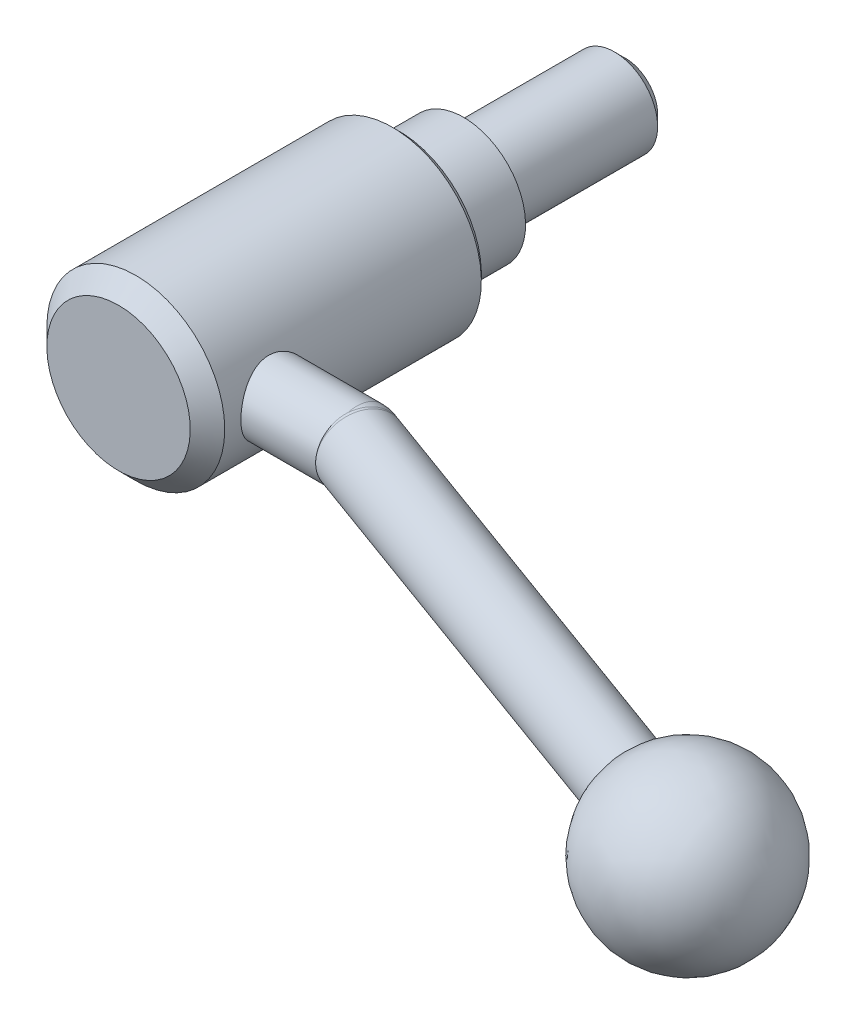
ISO-10303-21;
HEADER;
FILE_DESCRIPTION(('STEP AP214'),'2;1');
FILE_NAME('part.step','',(''),(''),'','','');
FILE_SCHEMA(('AUTOMOTIVE_DESIGN { 1 0 10303 214 1 1 1 1 }'));
ENDSEC;
DATA;
#1=APPLICATION_CONTEXT('core data for automotive mechanical design processes');
#2=APPLICATION_PROTOCOL_DEFINITION('international standard','automotive_design',2000,#1);
#3=PRODUCT_CONTEXT('',#1,'mechanical');
#4=PRODUCT('Part','Part','',(#3));
#5=PRODUCT_RELATED_PRODUCT_CATEGORY('part','',(#4));
#6=PRODUCT_DEFINITION_FORMATION('','',#4);
#7=PRODUCT_DEFINITION_CONTEXT('part definition',#1,'design');
#8=PRODUCT_DEFINITION('design','',#6,#7);
#9=PRODUCT_DEFINITION_SHAPE('','',#8);
#10=(LENGTH_UNIT() NAMED_UNIT(*) SI_UNIT(.MILLI.,.METRE.));
#11=(NAMED_UNIT(*) PLANE_ANGLE_UNIT() SI_UNIT($,.RADIAN.));
#12=(NAMED_UNIT(*) SI_UNIT($,.STERADIAN.) SOLID_ANGLE_UNIT());
#13=UNCERTAINTY_MEASURE_WITH_UNIT(LENGTH_MEASURE(1.E-05),#10,'distance_accuracy_value','');
#14=(GEOMETRIC_REPRESENTATION_CONTEXT(3) GLOBAL_UNCERTAINTY_ASSIGNED_CONTEXT((#13)) GLOBAL_UNIT_ASSIGNED_CONTEXT((#10,
#11,#12)) REPRESENTATION_CONTEXT('',''));
#15=CARTESIAN_POINT('',(0.,0.,0.));
#16=DIRECTION('',(0.,0.,1.));
#17=DIRECTION('',(1.,0.,0.));
#18=AXIS2_PLACEMENT_3D('',#15,#16,#17);
#19=CARTESIAN_POINT('',(0.,0.,-14.386565));
#20=DIRECTION('',(0.,0.,1.));
#21=DIRECTION('',(0.,-1.,0.));
#22=AXIS2_PLACEMENT_3D('',#19,#20,#21);
#23=CYLINDRICAL_SURFACE('',#22,8.);
#24=CARTESIAN_POINT('',(0.,0.,-28.));
#25=DIRECTION('',(0.,0.,-1.));
#26=DIRECTION('',(-1.,0.,0.));
#27=AXIS2_PLACEMENT_3D('',#24,#25,#26);
#28=CIRCLE('',#27,8.);
#29=CARTESIAN_POINT('',(-8.,0.,-28.));
#30=VERTEX_POINT('',#29);
#31=EDGE_CURVE('E9',#30,#30,#28,.F.);
#32=ORIENTED_EDGE('',*,*,#31,.T.);
#33=EDGE_LOOP('',(#32));
#34=FACE_BOUND('',#33,.T.);
#35=CARTESIAN_POINT('',(0.,0.,0.));
#36=DIRECTION('',(0.,0.,1.));
#37=DIRECTION('',(0.,-1.,0.));
#38=AXIS2_PLACEMENT_3D('',#35,#36,#37);
#39=CIRCLE('',#38,8.);
#40=CARTESIAN_POINT('',(0.,-8.,0.));
#41=VERTEX_POINT('',#40);
#42=EDGE_CURVE('E144',#41,#41,#39,.T.);
#43=ORIENTED_EDGE('',*,*,#42,.F.);
#44=EDGE_LOOP('',(#43));
#45=FACE_BOUND('',#44,.T.);
#46=ADVANCED_FACE('F14',(#34,#45),#23,.T.);
#47=CARTESIAN_POINT('',(9.75,0.,0.));
#48=DIRECTION('',(0.,0.,-1.));
#49=DIRECTION('',(0.,1.,0.));
#50=AXIS2_PLACEMENT_3D('',#47,#48,#49);
#51=PLANE('',#50);
#52=ORIENTED_EDGE('',*,*,#42,.T.);
#53=EDGE_LOOP('',(#52));
#54=FACE_BOUND('',#53,.T.);
#55=CARTESIAN_POINT('',(0.,0.,0.));
#56=DIRECTION('',(0.,0.,1.));
#57=DIRECTION('',(0.,-1.,0.));
#58=AXIS2_PLACEMENT_3D('',#55,#56,#57);
#59=CIRCLE('',#58,11.5);
#60=CARTESIAN_POINT('',(0.,-11.5,0.));
#61=VERTEX_POINT('',#60);
#62=EDGE_CURVE('E141',#61,#61,#59,.T.);
#63=ORIENTED_EDGE('',*,*,#62,.F.);
#64=EDGE_LOOP('',(#63));
#65=FACE_BOUND('',#64,.T.);
#66=ADVANCED_FACE('F148',(#54,#65),#51,.T.);
#67=CARTESIAN_POINT('',(0.,0.,6.));
#68=DIRECTION('',(0.,0.,1.));
#69=DIRECTION('',(0.,-1.,0.));
#70=AXIS2_PLACEMENT_3D('',#67,#68,#69);
#71=CYLINDRICAL_SURFACE('',#70,11.5);
#72=CARTESIAN_POINT('',(0.,0.,12.));
#73=DIRECTION('',(0.,0.,1.));
#74=DIRECTION('',(0.,-1.,0.));
#75=AXIS2_PLACEMENT_3D('',#72,#73,#74);
#76=CIRCLE('',#75,11.5);
#77=CARTESIAN_POINT('',(0.,-11.5,12.));
#78=VERTEX_POINT('',#77);
#79=EDGE_CURVE('E136',#78,#78,#76,.T.);
#80=ORIENTED_EDGE('',*,*,#79,.F.);
#81=EDGE_LOOP('',(#80));
#82=FACE_BOUND('',#81,.T.);
#83=ORIENTED_EDGE('',*,*,#62,.T.);
#84=EDGE_LOOP('',(#83));
#85=FACE_BOUND('',#84,.T.);
#86=ADVANCED_FACE('F158',(#82,#85),#71,.T.);
#87=CARTESIAN_POINT('',(13.4,0.,12.));
#88=DIRECTION('',(0.,0.,-1.));
#89=DIRECTION('',(0.,1.,0.));
#90=AXIS2_PLACEMENT_3D('',#87,#88,#89);
#91=PLANE('',#90);
#92=ORIENTED_EDGE('',*,*,#79,.T.);
#93=EDGE_LOOP('',(#92));
#94=FACE_BOUND('',#93,.T.);
#95=CARTESIAN_POINT('',(0.,0.,12.));
#96=DIRECTION('',(0.,0.,1.));
#97=DIRECTION('',(0.,-1.,0.));
#98=AXIS2_PLACEMENT_3D('',#95,#96,#97);
#99=CIRCLE('',#98,15.3);
#100=CARTESIAN_POINT('',(0.,-15.3,12.));
#101=VERTEX_POINT('',#100);
#102=EDGE_CURVE('E134',#101,#101,#99,.T.);
#103=ORIENTED_EDGE('',*,*,#102,.F.);
#104=EDGE_LOOP('',(#103));
#105=FACE_BOUND('',#104,.T.);
#106=ADVANCED_FACE('F163',(#94,#105),#91,.T.);
#107=CARTESIAN_POINT('',(6.65,0.,64.));
#108=DIRECTION('',(0.,0.,1.));
#109=DIRECTION('',(0.,-1.,0.));
#110=AXIS2_PLACEMENT_3D('',#107,#108,#109);
#111=PLANE('',#110);
#112=CARTESIAN_POINT('',(0.,0.,64.));
#113=DIRECTION('',(0.,0.,-1.));
#114=DIRECTION('',(0.,1.,0.));
#115=AXIS2_PLACEMENT_3D('',#112,#113,#114);
#116=CIRCLE('',#115,13.3);
#117=CARTESIAN_POINT('',(0.,13.3,64.));
#118=VERTEX_POINT('',#117);
#119=EDGE_CURVE('E118',#118,#118,#116,.T.);
#120=ORIENTED_EDGE('',*,*,#119,.F.);
#121=EDGE_LOOP('',(#120));
#122=FACE_BOUND('',#121,.T.);
#123=ADVANCED_FACE('F167',(#122),#111,.T.);
#124=CARTESIAN_POINT('',(0.,0.,13.2));
#125=DIRECTION('',(0.,0.,1.));
#126=DIRECTION('',(0.,-1.,0.));
#127=AXIS2_PLACEMENT_3D('',#124,#125,#126);
#128=CONICAL_SURFACE('',#127,16.5,0.785398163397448);
#129=ORIENTED_EDGE('',*,*,#102,.T.);
#130=EDGE_LOOP('',(#129));
#131=FACE_BOUND('',#130,.T.);
#132=CARTESIAN_POINT('',(0.,0.,13.2));
#133=DIRECTION('',(0.,0.,1.));
#134=DIRECTION('',(0.,-1.,0.));
#135=AXIS2_PLACEMENT_3D('',#132,#133,#134);
#136=CIRCLE('',#135,16.5);
#137=CARTESIAN_POINT('',(0.,-16.5,13.2));
#138=VERTEX_POINT('',#137);
#139=EDGE_CURVE('E111',#138,#138,#136,.T.);
#140=ORIENTED_EDGE('',*,*,#139,.F.);
#141=EDGE_LOOP('',(#140));
#142=FACE_BOUND('',#141,.T.);
#143=ADVANCED_FACE('F129',(#131,#142),#128,.T.);
#144=CARTESIAN_POINT('',(0.,0.,60.8));
#145=DIRECTION('',(0.,0.,-1.));
#146=DIRECTION('',(0.,1.,0.));
#147=AXIS2_PLACEMENT_3D('',#144,#145,#146);
#148=CONICAL_SURFACE('',#147,16.5,0.785398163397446);
#149=CARTESIAN_POINT('',(0.,0.,60.8));
#150=DIRECTION('',(0.,0.,1.));
#151=DIRECTION('',(0.,-1.,0.));
#152=AXIS2_PLACEMENT_3D('',#149,#150,#151);
#153=CIRCLE('',#152,16.5);
#154=CARTESIAN_POINT('',(0.,-16.5,60.8));
#155=VERTEX_POINT('',#154);
#156=EDGE_CURVE('E47',#155,#155,#153,.F.);
#157=ORIENTED_EDGE('',*,*,#156,.F.);
#158=EDGE_LOOP('',(#157));
#159=FACE_BOUND('',#158,.T.);
#160=ORIENTED_EDGE('',*,*,#119,.T.);
#161=EDGE_LOOP('',(#160));
#162=FACE_BOUND('',#161,.T.);
#163=ADVANCED_FACE('F126',(#159,#162),#148,.T.);
#164=CARTESIAN_POINT('',(0.,0.,37.));
#165=DIRECTION('',(0.,0.,1.));
#166=DIRECTION('',(0.,-1.,0.));
#167=AXIS2_PLACEMENT_3D('',#164,#165,#166);
#168=CYLINDRICAL_SURFACE('',#167,16.5);
#169=ORIENTED_EDGE('',*,*,#139,.T.);
#170=EDGE_LOOP('',(#169));
#171=FACE_BOUND('',#170,.T.);
#172=ORIENTED_EDGE('',*,*,#156,.T.);
#173=EDGE_LOOP('',(#172));
#174=FACE_BOUND('',#173,.T.);
#175=CARTESIAN_POINT('',(15.1657508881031,-6.5,51.3));
#176=CARTESIAN_POINT('',(15.165745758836,-6.50000508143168,51.1253356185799));
#177=CARTESIAN_POINT('',(15.1687745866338,-6.4929568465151,50.9507222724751));
#178=CARTESIAN_POINT('',(15.1807749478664,-6.46485327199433,50.6027802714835));
#179=CARTESIAN_POINT('',(15.1897474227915,-6.44379571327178,50.4294518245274));
#180=CARTESIAN_POINT('',(15.2133459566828,-6.38788044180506,50.0853414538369));
#181=CARTESIAN_POINT('',(15.2279750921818,-6.35301521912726,49.9145609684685));
#182=CARTESIAN_POINT('',(15.2624132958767,-6.26982978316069,49.5767762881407));
#183=CARTESIAN_POINT('',(15.2822244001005,-6.22150428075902,49.4097736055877));
#184=CARTESIAN_POINT('',(15.3263261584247,-6.1120529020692,49.0812888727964));
#185=CARTESIAN_POINT('',(15.3506010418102,-6.05097199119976,48.919789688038));
#186=CARTESIAN_POINT('',(15.4029664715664,-5.91640387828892,48.6026208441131));
#187=CARTESIAN_POINT('',(15.4310584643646,-5.84291197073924,48.4469534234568));
#188=CARTESIAN_POINT('',(15.4902542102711,-5.68411811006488,48.1424245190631));
#189=CARTESIAN_POINT('',(15.5213571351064,-5.59881940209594,47.9935611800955));
#190=CARTESIAN_POINT('',(15.5857641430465,-5.4169422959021,47.7033239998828));
#191=CARTESIAN_POINT('',(15.6190690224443,-5.32035980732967,47.5619529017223));
#192=CARTESIAN_POINT('',(15.6887193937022,-5.11143835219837,47.2806209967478));
#193=CARTESIAN_POINT('',(15.725133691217,-4.99855381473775,47.14108210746));
#194=CARTESIAN_POINT('',(15.7984639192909,-4.76171225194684,46.8718807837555));
#195=CARTESIAN_POINT('',(15.8353798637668,-4.63775491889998,46.7422186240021));
#196=CARTESIAN_POINT('',(15.9087667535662,-4.37940403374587,46.4934424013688));
#197=CARTESIAN_POINT('',(15.9452374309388,-4.24500452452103,46.3743344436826));
#198=CARTESIAN_POINT('',(16.0167560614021,-3.96663185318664,46.1475194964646));
#199=CARTESIAN_POINT('',(16.0518045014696,-3.8226620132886,46.0398085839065));
#200=CARTESIAN_POINT('',(16.1209091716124,-3.52012556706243,45.8324927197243));
#201=CARTESIAN_POINT('',(16.1548735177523,-3.36120877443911,45.7333671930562));
#202=CARTESIAN_POINT('',(16.219333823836,-3.03493842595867,45.5489784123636));
#203=CARTESIAN_POINT('',(16.2498311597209,-2.86758825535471,45.4637096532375));
#204=CARTESIAN_POINT('',(16.3064735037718,-2.52565072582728,45.3078089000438));
#205=CARTESIAN_POINT('',(16.3326221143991,-2.35106950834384,45.2371647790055));
#206=CARTESIAN_POINT('',(16.3798219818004,-1.99588359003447,45.1111415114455));
#207=CARTESIAN_POINT('',(16.4008745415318,-1.81528044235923,45.0557584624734));
#208=CARTESIAN_POINT('',(16.4454357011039,-1.36695920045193,44.9394592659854));
#209=CARTESIAN_POINT('',(16.4657881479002,-1.09660341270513,44.8872635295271));
#210=CARTESIAN_POINT('',(16.4930664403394,-0.550789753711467,44.8175398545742));
#211=CARTESIAN_POINT('',(16.4999939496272,-0.275332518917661,44.800007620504));
#212=CARTESIAN_POINT('',(16.5000038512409,0.175257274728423,44.7999951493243));
#213=CARTESIAN_POINT('',(16.4972033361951,0.350464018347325,44.8070907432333));
#214=CARTESIAN_POINT('',(16.4860855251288,0.699610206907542,44.8353885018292));
#215=CARTESIAN_POINT('',(16.4777673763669,0.873549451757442,44.8565928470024));
#216=CARTESIAN_POINT('',(16.4558274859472,1.21889636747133,44.9129094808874));
#217=CARTESIAN_POINT('',(16.4422032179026,1.39030279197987,44.9480283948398));
#218=CARTESIAN_POINT('',(16.4100071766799,1.72935619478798,45.0318397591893));
#219=CARTESIAN_POINT('',(16.3914335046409,1.8970017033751,45.0805374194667));
#220=CARTESIAN_POINT('',(16.3498830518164,2.22685454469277,45.1908856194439));
#221=CARTESIAN_POINT('',(16.3269192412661,2.38907628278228,45.2524980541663));
#222=CARTESIAN_POINT('',(16.2771221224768,2.70763704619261,45.3882581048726));
#223=CARTESIAN_POINT('',(16.2502873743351,2.86397385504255,45.4624103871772));
#224=CARTESIAN_POINT('',(16.1934219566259,3.16974182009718,45.6226308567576));
#225=CARTESIAN_POINT('',(16.1633922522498,3.31917504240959,45.7086954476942));
#226=CARTESIAN_POINT('',(16.1008405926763,3.61041938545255,45.892180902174));
#227=CARTESIAN_POINT('',(16.0683177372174,3.752227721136,45.9896058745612));
#228=CARTESIAN_POINT('',(16.0001727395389,4.03314016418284,46.1994336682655));
#229=CARTESIAN_POINT('',(15.9644779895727,4.17188782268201,46.3122902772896));
#230=CARTESIAN_POINT('',(15.892142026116,4.43948611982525,46.5489090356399));
#231=CARTESIAN_POINT('',(15.8555007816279,4.56833643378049,46.6726715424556));
#232=CARTESIAN_POINT('',(15.7821969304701,4.81548386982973,46.9304447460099));
#233=CARTESIAN_POINT('',(15.7455343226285,4.93377545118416,47.0644607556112));
#234=CARTESIAN_POINT('',(15.6731846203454,5.15899919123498,47.3418892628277));
#235=CARTESIAN_POINT('',(15.6374972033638,5.26593514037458,47.4852985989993));
#236=CARTESIAN_POINT('',(15.5665464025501,5.4722064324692,47.7871932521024));
#237=CARTESIAN_POINT('',(15.5313687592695,5.57100992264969,47.9460628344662));
#238=CARTESIAN_POINT('',(15.4642240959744,5.75476702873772,48.2721837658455));
#239=CARTESIAN_POINT('',(15.4322557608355,5.83972632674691,48.4394316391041));
#240=CARTESIAN_POINT('',(15.3725571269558,5.99511642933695,48.7813028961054));
#241=CARTESIAN_POINT('',(15.3448272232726,6.06554587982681,48.9559269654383));
#242=CARTESIAN_POINT('',(15.2945852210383,6.19114229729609,49.311222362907));
#243=CARTESIAN_POINT('',(15.2720705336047,6.24631683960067,49.4918906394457));
#244=CARTESIAN_POINT('',(15.2339240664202,6.33876553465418,49.8499242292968));
#245=CARTESIAN_POINT('',(15.2180336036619,6.37671895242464,50.0270865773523));
#246=CARTESIAN_POINT('',(15.1923255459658,6.43772822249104,50.3843194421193));
#247=CARTESIAN_POINT('',(15.1825052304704,6.4607907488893,50.5643886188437));
#248=CARTESIAN_POINT('',(15.1692851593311,6.49176962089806,50.9260259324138));
#249=CARTESIAN_POINT('',(15.1658841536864,6.49968891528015,51.107593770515));
#250=CARTESIAN_POINT('',(15.1656253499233,6.50029305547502,51.4707553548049));
#251=CARTESIAN_POINT('',(15.1687672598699,6.49297858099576,51.6523490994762));
#252=CARTESIAN_POINT('',(15.1810465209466,6.4642126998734,52.0018533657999));
#253=CARTESIAN_POINT('',(15.1897653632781,6.44374768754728,52.169860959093));
#254=CARTESIAN_POINT('',(15.2125161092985,6.38985201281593,52.5034742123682));
#255=CARTESIAN_POINT('',(15.2265497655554,6.35641707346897,52.6690790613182));
#256=CARTESIAN_POINT('',(15.2594944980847,6.27691602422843,52.9966826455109));
#257=CARTESIAN_POINT('',(15.2784043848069,6.2308529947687,53.158682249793));
#258=CARTESIAN_POINT('',(15.3205529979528,6.12648519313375,53.4781720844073));
#259=CARTESIAN_POINT('',(15.3437933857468,6.06817572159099,53.6356605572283));
#260=CARTESIAN_POINT('',(15.3944388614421,5.93853407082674,53.9482065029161));
#261=CARTESIAN_POINT('',(15.4219169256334,5.86696813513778,54.103155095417));
#262=CARTESIAN_POINT('',(15.4799371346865,5.71212576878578,54.4065474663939));
#263=CARTESIAN_POINT('',(15.5104803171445,5.62884536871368,54.5549890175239));
#264=CARTESIAN_POINT('',(15.573821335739,5.45114518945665,54.8445557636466));
#265=CARTESIAN_POINT('',(15.6066193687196,5.35672443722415,54.9856803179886));
#266=CARTESIAN_POINT('',(15.6736444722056,5.15731826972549,55.2599004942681));
#267=CARTESIAN_POINT('',(15.7078716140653,5.05233232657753,55.392995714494));
#268=CARTESIAN_POINT('',(15.779514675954,4.82413356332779,55.6601446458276));
#269=CARTESIAN_POINT('',(15.8169774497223,4.70014455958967,55.7935237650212));
#270=CARTESIAN_POINT('',(15.8915700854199,4.44140964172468,56.0494187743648));
#271=CARTESIAN_POINT('',(15.9287000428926,4.3066669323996,56.171937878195));
#272=CARTESIAN_POINT('',(16.0016814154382,4.0270441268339,56.4054996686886));
#273=CARTESIAN_POINT('',(16.0375317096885,3.88215545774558,56.5165324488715));
#274=CARTESIAN_POINT('',(16.106952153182,3.58324186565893,56.7262041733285));
#275=CARTESIAN_POINT('',(16.1405232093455,3.42922062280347,56.8248480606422));
#276=CARTESIAN_POINT('',(16.20513395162,3.10977568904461,57.0108780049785));
#277=CARTESIAN_POINT('',(16.2361103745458,2.94418663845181,57.0980025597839));
#278=CARTESIAN_POINT('',(16.293877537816,2.60557789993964,57.2578518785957));
#279=CARTESIAN_POINT('',(16.3206700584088,2.43256141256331,57.3305827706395));
#280=CARTESIAN_POINT('',(16.3692672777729,2.08053032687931,57.4608897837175));
#281=CARTESIAN_POINT('',(16.3910795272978,1.90152528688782,57.5184888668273));
#282=CARTESIAN_POINT('',(16.4291085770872,1.53871493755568,57.6180476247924));
#283=CARTESIAN_POINT('',(16.4453277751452,1.35491172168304,57.6600140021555));
#284=CARTESIAN_POINT('',(16.4721817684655,0.976957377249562,57.7291390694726));
#285=CARTESIAN_POINT('',(16.4825841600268,0.782676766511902,57.7556829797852));
#286=CARTESIAN_POINT('',(16.4964929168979,0.392259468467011,57.7911129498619));
#287=CARTESIAN_POINT('',(16.4999993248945,0.196122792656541,57.7999991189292));
#288=CARTESIAN_POINT('',(16.5000006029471,-0.175160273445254,57.8000007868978));
#289=CARTESIAN_POINT('',(16.4972048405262,-0.350309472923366,57.7929141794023));
#290=CARTESIAN_POINT('',(16.4860972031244,-0.699350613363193,57.7646401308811));
#291=CARTESIAN_POINT('',(16.4777835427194,-0.873242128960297,57.7434481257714));
#292=CARTESIAN_POINT('',(16.4558494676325,-1.21860319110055,57.6871474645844));
#293=CARTESIAN_POINT('',(16.4422234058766,-1.39006995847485,57.6520239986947));
#294=CARTESIAN_POINT('',(16.4100199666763,-1.72924172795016,57.5681936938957));
#295=CARTESIAN_POINT('',(16.3914406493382,-1.89694522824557,57.5194815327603));
#296=CARTESIAN_POINT('',(16.3498814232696,-2.22686723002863,57.4091100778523));
#297=CARTESIAN_POINT('',(16.3269156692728,-2.38910145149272,57.3474923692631));
#298=CARTESIAN_POINT('',(16.2771139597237,-2.70768694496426,57.2117194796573));
#299=CARTESIAN_POINT('',(16.250276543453,-2.86403596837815,57.137559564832));
#300=CARTESIAN_POINT('',(16.1934100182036,-3.16980213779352,56.9773350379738));
#301=CARTESIAN_POINT('',(16.1633823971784,-3.31922246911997,56.8912759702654));
#302=CARTESIAN_POINT('',(16.100835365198,-3.61044218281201,56.7078034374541));
#303=CARTESIAN_POINT('',(16.0683150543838,-3.75223878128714,56.6103858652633));
#304=CARTESIAN_POINT('',(16.0001757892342,-4.03312759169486,56.400575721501));
#305=CARTESIAN_POINT('',(15.9644842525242,-4.17186347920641,56.2877295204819));
#306=CARTESIAN_POINT('',(15.8921547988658,-4.43944004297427,56.0511334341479));
#307=CARTESIAN_POINT('',(15.8555168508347,-4.56828039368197,55.9273831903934));
#308=CARTESIAN_POINT('',(15.7822130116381,-4.81543151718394,55.6696135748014));
#309=CARTESIAN_POINT('',(15.7455471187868,-4.93373489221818,55.5355871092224));
#310=CARTESIAN_POINT('',(15.673190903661,-5.15898035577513,55.2581360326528));
#311=CARTESIAN_POINT('',(15.6375002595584,-5.26592622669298,55.1147145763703));
#312=CARTESIAN_POINT('',(15.5665307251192,-5.47225204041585,54.8127398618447));
#313=CARTESIAN_POINT('',(15.5313383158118,-5.57109554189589,54.6537989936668));
#314=CARTESIAN_POINT('',(15.4641668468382,-5.75492139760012,54.3275284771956));
#315=CARTESIAN_POINT('',(15.4321865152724,-5.83990924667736,54.1602021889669));
#316=CARTESIAN_POINT('',(15.3724986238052,-5.9952660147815,53.8183316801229));
#317=CARTESIAN_POINT('',(15.3447872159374,-6.06564811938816,53.6437941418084));
#318=CARTESIAN_POINT('',(15.2945703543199,-6.191177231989,53.2886684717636));
#319=CARTESIAN_POINT('',(15.2720634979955,-6.24632834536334,53.1080819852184));
#320=CARTESIAN_POINT('',(15.2244373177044,-6.36176485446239,52.6609796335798));
#321=CARTESIAN_POINT('',(15.2025795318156,-6.41349655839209,52.3918451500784));
#322=CARTESIAN_POINT('',(15.1732415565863,-6.48260724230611,51.8484312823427));
#323=CARTESIAN_POINT('',(15.1657589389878,-6.49999202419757,51.574152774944));
#324=CARTESIAN_POINT('',(15.1657508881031,-6.5,51.3));
#325=B_SPLINE_CURVE_WITH_KNOTS('',3,(#175,#176,#177,#178,#179,#180,#181,#182,#183,#184,#185,
#186,#187,#188,#189,#190,#191,#192,#193,#194,#195,#196,#197,#198,#199,#200,#201,#202,#203,#204,
#205,#206,#207,#208,#209,#210,#211,#212,#213,#214,#215,#216,#217,#218,#219,#220,#221,#222,#223,
#224,#225,#226,#227,#228,#229,#230,#231,#232,#233,#234,#235,#236,#237,#238,#239,#240,#241,#242,
#243,#244,#245,#246,#247,#248,#249,#250,#251,#252,#253,#254,#255,#256,#257,#258,#259,#260,#261,
#262,#263,#264,#265,#266,#267,#268,#269,#270,#271,#272,#273,#274,#275,#276,#277,#278,#279,#280,
#281,#282,#283,#284,#285,#286,#287,#288,#289,#290,#291,#292,#293,#294,#295,#296,#297,#298,#299,
#300,#301,#302,#303,#304,#305,#306,#307,#308,#309,#310,#311,#312,#313,#314,#315,#316,#317,#318,
#319,#320,#321,#322,#323,#324),.UNSPECIFIED.,.T.,.F.,(4,2,2,2,2,2,2,2,2,2,2,2,2,2,2,2,2,2,2,2,2,
2,2,2,2,2,2,2,2,2,2,2,2,2,2,2,2,2,2,2,2,2,2,2,2,2,2,2,2,2,2,2,2,2,2,2,2,2,2,2,2,2,2,2,2,2,2,2,2,
2,2,2,2,2,4),(0.,0.523737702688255,1.04755838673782,1.57166436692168,2.09597658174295,
2.61847078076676,3.14116352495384,3.66371288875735,4.18645226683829,4.73526045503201,
5.28408389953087,5.83322277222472,6.38217200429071,6.95251243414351,7.5226257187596,
8.09226434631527,8.66175717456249,9.48746056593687,10.3130616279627,10.8385810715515,
11.3641817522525,11.890032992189,12.4160862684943,12.9406087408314,13.4653268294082,
13.9898868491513,14.5146371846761,15.0611644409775,15.6077096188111,16.1545399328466,
16.7011871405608,17.2715771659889,17.8417324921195,18.4119409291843,18.9818656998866,
19.5267807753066,20.0714514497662,20.6160160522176,21.1605563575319,21.6683825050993,
22.1763762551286,22.6842461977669,23.1923113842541,23.7103778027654,24.228620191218,
24.7469078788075,25.2652214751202,25.8223490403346,26.3793111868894,26.9367497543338,
27.4939651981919,28.0622107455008,28.6302138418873,29.1973499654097,29.7642426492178,
30.352408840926,30.9405713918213,31.4658683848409,31.991335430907,32.5173625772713,
33.0435960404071,33.5681592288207,34.0929208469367,34.6174387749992,35.1421469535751,
35.6886262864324,36.235123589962,36.7820016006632,37.3286969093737,37.8993337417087,
38.4697437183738,39.0396364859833,39.6093754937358,40.4315717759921,41.2536291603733),.UNSPECIFIED.);
#326=CARTESIAN_POINT('',(15.1657508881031,-6.5,51.3));
#327=VERTEX_POINT('',#326);
#328=EDGE_CURVE('E46',#327,#327,#325,.T.);
#329=ORIENTED_EDGE('',*,*,#328,.F.);
#330=EDGE_LOOP('',(#329));
#331=FACE_BOUND('',#330,.T.);
#332=ADVANCED_FACE('F123',(#171,#174,#331),#168,.T.);
#333=CARTESIAN_POINT('',(31.5,0.,51.3));
#334=DIRECTION('',(1.,0.,0.));
#335=DIRECTION('',(0.,0.,1.));
#336=AXIS2_PLACEMENT_3D('',#333,#334,#335);
#337=SPHERICAL_SURFACE('',#336,6.5);
#338=CARTESIAN_POINT('',(31.5,0.,51.3));
#339=DIRECTION('',(-1.,0.,0.));
#340=DIRECTION('',(0.,-1.,0.));
#341=AXIS2_PLACEMENT_3D('',#338,#339,#340);
#342=CIRCLE('',#341,6.5);
#343=CARTESIAN_POINT('',(31.5,6.28033613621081,52.9755232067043));
#344=VERTEX_POINT('',#343);
#345=CARTESIAN_POINT('',(31.5,-6.28033613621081,52.9755232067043));
#346=VERTEX_POINT('',#345);
#347=EDGE_CURVE('E35',#344,#346,#342,.T.);
#348=ORIENTED_EDGE('',*,*,#347,.F.);
#349=CARTESIAN_POINT('',(31.5,-6.28033613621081,52.9755232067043));
#350=CARTESIAN_POINT('',(31.5604115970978,-6.32463778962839,52.8095437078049));
#351=CARTESIAN_POINT('',(31.6214644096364,-6.3614496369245,52.6418024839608));
#352=CARTESIAN_POINT('',(31.7444103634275,-6.41991545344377,52.3040112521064));
#353=CARTESIAN_POINT('',(31.8063034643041,-6.44157014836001,52.133961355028));
#354=CARTESIAN_POINT('',(31.9304500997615,-6.46953783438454,51.7928712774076));
#355=CARTESIAN_POINT('',(31.9927033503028,-6.47586160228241,51.6218318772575));
#356=CARTESIAN_POINT('',(32.1171700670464,-6.47316004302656,51.2798623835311));
#357=CARTESIAN_POINT('',(32.1793835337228,-6.46413490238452,51.1089322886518));
#358=CARTESIAN_POINT('',(32.3033473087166,-6.43079358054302,50.768344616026));
#359=CARTESIAN_POINT('',(32.3650974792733,-6.4064730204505,50.598687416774));
#360=CARTESIAN_POINT('',(32.4877003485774,-6.34269837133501,50.2618388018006));
#361=CARTESIAN_POINT('',(32.5485527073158,-6.30323869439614,50.0946483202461));
#362=CARTESIAN_POINT('',(32.6688696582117,-6.20949357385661,49.764080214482));
#363=CARTESIAN_POINT('',(32.7283350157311,-6.15521652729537,49.6007004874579));
#364=CARTESIAN_POINT('',(32.8455127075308,-6.03218986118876,49.2787574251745));
#365=CARTESIAN_POINT('',(32.9032243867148,-5.96343490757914,49.1201958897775));
#366=CARTESIAN_POINT('',(33.0164417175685,-5.8119796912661,48.809133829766));
#367=CARTESIAN_POINT('',(33.0719481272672,-5.72928427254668,48.6566312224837));
#368=CARTESIAN_POINT('',(33.1804017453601,-5.55048605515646,48.3586573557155));
#369=CARTESIAN_POINT('',(33.2333480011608,-5.45437831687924,48.2131887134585));
#370=CARTESIAN_POINT('',(33.3362716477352,-5.2494843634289,47.9304083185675));
#371=CARTESIAN_POINT('',(33.3862496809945,-5.14070090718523,47.7930948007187));
#372=CARTESIAN_POINT('',(33.4829120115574,-4.91116949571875,47.5275172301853));
#373=CARTESIAN_POINT('',(33.5295950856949,-4.79041713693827,47.3992565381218));
#374=CARTESIAN_POINT('',(33.6192965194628,-4.53789283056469,47.1528038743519));
#375=CARTESIAN_POINT('',(33.662316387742,-4.40612546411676,47.0346077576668));
#376=CARTESIAN_POINT('',(33.7444224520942,-4.13241387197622,46.8090231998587));
#377=CARTESIAN_POINT('',(33.7835071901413,-3.99046590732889,46.7016387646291));
#378=CARTESIAN_POINT('',(33.85743093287,-3.69750906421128,46.4985349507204));
#379=CARTESIAN_POINT('',(33.8922717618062,-3.54650412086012,46.4028105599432));
#380=CARTESIAN_POINT('',(33.9574917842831,-3.23639397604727,46.2236200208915));
#381=CARTESIAN_POINT('',(33.9878693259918,-3.07728580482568,46.1401584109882));
#382=CARTESIAN_POINT('',(34.043921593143,-2.75220747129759,45.9861560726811));
#383=CARTESIAN_POINT('',(34.0695979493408,-2.58623971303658,45.9156108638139));
#384=CARTESIAN_POINT('',(34.1160870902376,-2.2485120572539,45.7878829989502));
#385=CARTESIAN_POINT('',(34.1368980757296,-2.07675004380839,45.7307052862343));
#386=CARTESIAN_POINT('',(34.1734894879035,-1.72875737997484,45.6301712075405));
#387=CARTESIAN_POINT('',(34.1892716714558,-1.55252831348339,45.5868100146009));
#388=CARTESIAN_POINT('',(34.2157095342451,-1.19679469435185,45.5141725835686));
#389=CARTESIAN_POINT('',(34.2263633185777,-1.01728895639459,45.484901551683));
#390=CARTESIAN_POINT('',(34.2504829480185,-0.47589972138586,45.4186334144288));
#391=CARTESIAN_POINT('',(34.256147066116,-0.110762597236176,45.4030713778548));
#392=CARTESIAN_POINT('',(34.2464222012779,0.616910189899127,45.4297902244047));
#393=CARTESIAN_POINT('',(34.2310332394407,0.979445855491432,45.4720710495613));
#394=CARTESIAN_POINT('',(34.1796583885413,1.6918734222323,45.6132222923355));
#395=CARTESIAN_POINT('',(34.1436723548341,2.04176523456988,45.7120931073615));
#396=CARTESIAN_POINT('',(34.0521201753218,2.71889949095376,45.9636306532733));
#397=CARTESIAN_POINT('',(33.9965542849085,3.0461422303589,46.1162966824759));
#398=CARTESIAN_POINT('',(33.8674217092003,3.66870864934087,46.4710855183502));
#399=CARTESIAN_POINT('',(33.7938552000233,3.96403264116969,46.6732078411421));
#400=CARTESIAN_POINT('',(33.6308061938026,4.51438637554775,47.1211813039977));
#401=CARTESIAN_POINT('',(33.541323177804,4.76941480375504,47.3670338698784));
#402=CARTESIAN_POINT('',(33.3489838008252,5.23192699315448,47.8954819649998));
#403=CARTESIAN_POINT('',(33.2461274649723,5.43941084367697,48.1780774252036));
#404=CARTESIAN_POINT('',(33.0299624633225,5.80093835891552,48.7719858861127));
#405=CARTESIAN_POINT('',(32.916654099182,5.9549835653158,49.083298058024));
#406=CARTESIAN_POINT('',(32.6827891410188,6.20528929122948,49.7258367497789));
#407=CARTESIAN_POINT('',(32.5622315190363,6.30154159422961,50.0570660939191));
#408=CARTESIAN_POINT('',(32.3173112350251,6.43346974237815,50.7299790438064));
#409=CARTESIAN_POINT('',(32.1929495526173,6.46916105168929,51.0716599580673));
#410=CARTESIAN_POINT('',(31.9727599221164,6.47789082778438,51.6766259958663));
#411=CARTESIAN_POINT('',(31.876974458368,6.46349392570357,51.9397943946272));
#412=CARTESIAN_POINT('',(31.7344650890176,6.41489914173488,52.3313356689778));
#413=CARTESIAN_POINT('',(31.687169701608,6.39421043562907,52.4612786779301));
#414=CARTESIAN_POINT('',(31.5931272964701,6.34392911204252,52.7196580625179));
#415=CARTESIAN_POINT('',(31.5463803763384,6.31433493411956,52.8480941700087));
#416=CARTESIAN_POINT('',(31.5,6.28033613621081,52.9755232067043));
#417=B_SPLINE_CURVE_WITH_KNOTS('',3,(#349,#350,#351,#352,#353,#354,#355,#356,#357,#358,#359,
#360,#361,#362,#363,#364,#365,#366,#367,#368,#369,#370,#371,#372,#373,#374,#375,#376,#377,#378,
#379,#380,#381,#382,#383,#384,#385,#386,#387,#388,#389,#390,#391,#392,#393,#394,#395,#396,#397,
#398,#399,#400,#401,#402,#403,#404,#405,#406,#407,#408,#409,#410,#411,#412,#413,#414,#415,#416),
.UNSPECIFIED.,.F.,.F.,(4,2,2,2,2,2,2,2,2,2,2,2,2,2,2,2,2,2,2,2,2,2,2,2,2,2,2,2,2,2,2,2,2,4),(0.,
0.546141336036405,1.09225652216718,1.63798770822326,2.1837122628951,2.72959312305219,
3.27567566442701,3.82144937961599,4.36742452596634,4.91321034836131,5.45919771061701,
6.0050664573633,6.55113678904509,7.09698112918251,7.64302697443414,8.18883726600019,
8.73484905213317,9.28067107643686,9.82669462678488,10.3725272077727,10.918561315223,
12.0094472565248,13.100332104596,14.1912246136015,15.2821028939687,16.3729705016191,
17.4638736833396,18.5547748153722,19.645644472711,20.7366691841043,21.827415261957,
22.6662852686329,23.0854882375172,23.5047647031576),.UNSPECIFIED.);
#418=EDGE_CURVE('E49',#346,#344,#417,.T.);
#419=ORIENTED_EDGE('',*,*,#418,.F.);
#420=EDGE_LOOP('',(#348,#419));
#421=FACE_BOUND('',#420,.T.);
#422=ADVANCED_FACE('F50',(#421),#337,.T.);
#423=CARTESIAN_POINT('',(15.75,0.,51.3));
#424=DIRECTION('',(-1.,0.,0.));
#425=DIRECTION('',(0.,-1.,0.));
#426=AXIS2_PLACEMENT_3D('',#423,#424,#425);
#427=CYLINDRICAL_SURFACE('',#426,6.5);
#428=CARTESIAN_POINT('',(30.353874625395,0.,57.8));
#429=CARTESIAN_POINT('',(30.3538760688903,-0.180413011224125,57.8000209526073));
#430=CARTESIAN_POINT('',(30.3551991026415,-0.360822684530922,57.7924896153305));
#431=CARTESIAN_POINT('',(30.3604984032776,-0.72034373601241,57.7624738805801));
#432=CARTESIAN_POINT('',(30.3644745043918,-0.899455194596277,57.7399904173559));
#433=CARTESIAN_POINT('',(30.3750867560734,-1.25500271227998,57.6802401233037));
#434=CARTESIAN_POINT('',(30.3817212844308,-1.43144033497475,57.6429823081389));
#435=CARTESIAN_POINT('',(30.3976715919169,-1.78049689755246,57.5539799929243));
#436=CARTESIAN_POINT('',(30.4069873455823,-1.95311587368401,57.5022356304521));
#437=CARTESIAN_POINT('',(30.42833245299,-2.29333224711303,57.384654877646));
#438=CARTESIAN_POINT('',(30.4403620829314,-2.46092913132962,57.3188170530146));
#439=CARTESIAN_POINT('',(30.4671848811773,-2.7899775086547,57.173532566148));
#440=CARTESIAN_POINT('',(30.481979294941,-2.95142619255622,57.0940797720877));
#441=CARTESIAN_POINT('',(30.5143835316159,-3.26691386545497,56.9222351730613));
#442=CARTESIAN_POINT('',(30.5319923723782,-3.42095541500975,56.8298478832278));
#443=CARTESIAN_POINT('',(30.5701035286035,-3.72055534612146,56.6328784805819));
#444=CARTESIAN_POINT('',(30.5906045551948,-3.86611746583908,56.5283018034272));
#445=CARTESIAN_POINT('',(30.6347023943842,-4.14837693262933,56.3073163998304));
#446=CARTESIAN_POINT('',(30.6583107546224,-4.28503822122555,56.1908639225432));
#447=CARTESIAN_POINT('',(30.7087165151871,-4.5479574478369,55.9473847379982));
#448=CARTESIAN_POINT('',(30.7355139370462,-4.67421531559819,55.8203579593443));
#449=CARTESIAN_POINT('',(30.7925196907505,-4.9155279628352,55.5567044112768));
#450=CARTESIAN_POINT('',(30.8227291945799,-5.0305788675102,55.420074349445));
#451=CARTESIAN_POINT('',(30.8868489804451,-5.24868401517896,55.1383648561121));
#452=CARTESIAN_POINT('',(30.9207592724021,-5.35173822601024,54.9932854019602));
#453=CARTESIAN_POINT('',(30.991944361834,-5.54315969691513,54.6990494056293));
#454=CARTESIAN_POINT('',(31.0291330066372,-5.6317911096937,54.5500436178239));
#455=CARTESIAN_POINT('',(31.1080482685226,-5.79644456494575,54.2463609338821));
#456=CARTESIAN_POINT('',(31.1497744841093,-5.87246772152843,54.0916845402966));
#457=CARTESIAN_POINT('',(31.2164453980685,-5.97675614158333,53.8565126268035));
#458=CARTESIAN_POINT('',(31.2393571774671,-6.00990348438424,53.7775703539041));
#459=CARTESIAN_POINT('',(31.2867125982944,-6.07291452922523,53.6188354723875));
#460=CARTESIAN_POINT('',(31.311156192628,-6.10277833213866,53.5390428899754));
#461=CARTESIAN_POINT('',(31.361785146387,-6.15920167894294,53.3788091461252));
#462=CARTESIAN_POINT('',(31.3879711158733,-6.18576005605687,53.2983677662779));
#463=CARTESIAN_POINT('',(31.4423816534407,-6.23554888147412,53.1371353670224));
#464=CARTESIAN_POINT('',(31.4706064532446,-6.25877895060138,53.0563443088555));
#465=CARTESIAN_POINT('',(31.5,-6.28033613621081,52.9755232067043));
#466=B_SPLINE_CURVE_WITH_KNOTS('',3,(#428,#429,#430,#431,#432,#433,#434,#435,#436,#437,#438,
#439,#440,#441,#442,#443,#444,#445,#446,#447,#448,#449,#450,#451,#452,#453,#454,#455,#456,#457,
#458,#459,#460,#461,#462,#463,#464,#465),.UNSPECIFIED.,.F.,.F.,(4,2,2,2,2,2,2,2,2,2,2,2,2,2,2,2,
2,2,4),(0.,0.541072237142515,1.0821106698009,1.62281945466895,2.16352310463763,2.70428180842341,
3.24528469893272,3.78609920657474,4.32667346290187,4.86931655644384,5.41196331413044,
5.95479703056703,6.49763220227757,7.02900626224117,7.56033334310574,7.82616473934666,
8.09198796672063,8.3579047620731,8.62385182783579),.UNSPECIFIED.);
#467=CARTESIAN_POINT('',(30.3538746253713,0.,57.8));
#468=VERTEX_POINT('',#467);
#469=EDGE_CURVE('E42',#468,#346,#466,.T.);
#470=ORIENTED_EDGE('',*,*,#469,.F.);
#471=CARTESIAN_POINT('',(31.5,6.28033613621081,52.9755232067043));
#472=CARTESIAN_POINT('',(31.4799917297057,6.26566740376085,53.0305088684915));
#473=CARTESIAN_POINT('',(31.4605350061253,6.2502263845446,53.0854833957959));
#474=CARTESIAN_POINT('',(31.422614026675,6.21780122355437,53.1953164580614));
#475=CARTESIAN_POINT('',(31.404149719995,6.20081716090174,53.2501749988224));
#476=CARTESIAN_POINT('',(31.350095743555,6.14756914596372,53.4143861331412));
#477=CARTESIAN_POINT('',(31.315823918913,6.10899372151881,53.5234330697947));
#478=CARTESIAN_POINT('',(31.2502052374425,6.02574752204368,53.7400479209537));
#479=CARTESIAN_POINT('',(31.2188581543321,5.98107721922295,53.8476159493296));
#480=CARTESIAN_POINT('',(31.1586887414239,5.88575616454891,54.0607044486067));
#481=CARTESIAN_POINT('',(31.129864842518,5.8351091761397,54.1662261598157));
#482=CARTESIAN_POINT('',(31.0744189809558,5.72792472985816,54.3748382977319));
#483=CARTESIAN_POINT('',(31.0477971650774,5.67138687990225,54.4779285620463));
#484=CARTESIAN_POINT('',(30.9965376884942,5.55256954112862,54.6812483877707));
#485=CARTESIAN_POINT('',(30.9719000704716,5.49028992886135,54.7814778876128));
#486=CARTESIAN_POINT('',(30.9126002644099,5.327689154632,55.0278762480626));
#487=CARTESIAN_POINT('',(30.8790640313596,5.22388206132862,55.1720360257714));
#488=CARTESIAN_POINT('',(30.8156523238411,5.00438458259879,55.451838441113));
#489=CARTESIAN_POINT('',(30.7857767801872,4.88869442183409,55.5874812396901));
#490=CARTESIAN_POINT('',(30.7294047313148,4.64620709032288,55.8491274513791));
#491=CARTESIAN_POINT('',(30.7029071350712,4.51941352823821,55.9751339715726));
#492=CARTESIAN_POINT('',(30.6530744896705,4.25553131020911,56.2165469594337));
#493=CARTESIAN_POINT('',(30.6297394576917,4.11844259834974,56.3319533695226));
#494=CARTESIAN_POINT('',(30.5858558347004,3.83342873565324,56.5523913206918));
#495=CARTESIAN_POINT('',(30.5653385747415,3.68540613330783,56.657303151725));
#496=CARTESIAN_POINT('',(30.527257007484,3.38076547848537,56.8545811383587));
#497=CARTESIAN_POINT('',(30.5096940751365,3.22414346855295,56.9469414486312));
#498=CARTESIAN_POINT('',(30.4774435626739,2.90342410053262,57.1183503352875));
#499=CARTESIAN_POINT('',(30.4627569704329,2.73932419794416,57.1973943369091));
#500=CARTESIAN_POINT('',(30.4362115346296,2.4049534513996,57.3414668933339));
#501=CARTESIAN_POINT('',(30.4243513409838,2.23468559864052,57.4065021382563));
#502=CARTESIAN_POINT('',(30.4038395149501,1.89629760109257,57.5196908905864));
#503=CARTESIAN_POINT('',(30.3950753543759,1.72838048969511,57.5684319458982));
#504=CARTESIAN_POINT('',(30.3800690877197,1.38906161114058,57.6522477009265));
#505=CARTESIAN_POINT('',(30.373826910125,1.21765994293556,57.6873227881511));
#506=CARTESIAN_POINT('',(30.3638445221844,0.872477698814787,57.7435510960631));
#507=CARTESIAN_POINT('',(30.3601048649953,0.698696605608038,57.764701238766));
#508=CARTESIAN_POINT('',(30.3551204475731,0.349944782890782,57.792935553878));
#509=CARTESIAN_POINT('',(30.3538759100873,0.174973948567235,57.8000184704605));
#510=CARTESIAN_POINT('',(30.353874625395,0.,57.8));
#511=B_SPLINE_CURVE_WITH_KNOTS('',3,(#471,#472,#473,#474,#475,#476,#477,#478,#479,#480,#481,
#482,#483,#484,#485,#486,#487,#488,#489,#490,#491,#492,#493,#494,#495,#496,#497,#498,#499,#500,
#501,#502,#503,#504,#505,#506,#507,#508,#509,#510),.UNSPECIFIED.,.F.,.F.,(4,2,2,2,2,2,2,2,2,2,2,
2,2,2,2,2,2,2,2,4),(0.,0.1809535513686,0.361897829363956,0.723593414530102,1.0852609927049,
1.44670203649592,1.8081671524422,2.16964004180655,2.71132455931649,3.25299883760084,
3.79449771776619,4.3359995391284,4.88310452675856,5.43046343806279,5.97801001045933,
6.52529451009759,7.04991611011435,7.57452283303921,8.09924547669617,8.6240149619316),.UNSPECIFIED.);
#512=EDGE_CURVE('E44',#344,#468,#511,.T.);
#513=ORIENTED_EDGE('',*,*,#512,.F.);
#514=ORIENTED_EDGE('',*,*,#347,.T.);
#515=EDGE_LOOP('',(#470,#513,#514));
#516=FACE_BOUND('',#515,.T.);
#517=ORIENTED_EDGE('',*,*,#328,.T.);
#518=EDGE_LOOP('',(#517));
#519=FACE_BOUND('',#518,.T.);
#520=ADVANCED_FACE('F39',(#516,#519),#427,.T.);
#521=CARTESIAN_POINT('',(32.5770055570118,0.,51.6919979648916));
#522=DIRECTION('',(1.,0.,0.));
#523=DIRECTION('',(0.,0.,1.));
#524=AXIS2_PLACEMENT_3D('',#521,#522,#523);
#525=SPHERICAL_SURFACE('',#524,6.5);
#526=ORIENTED_EDGE('',*,*,#418,.T.);
#527=ORIENTED_EDGE('',*,*,#512,.T.);
#528=CARTESIAN_POINT('',(32.5770055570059,0.,51.6919979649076));
#529=DIRECTION('',(-0.939692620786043,0.,-0.342020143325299));
#530=DIRECTION('',(0.342020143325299,0.,-0.939692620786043));
#531=AXIS2_PLACEMENT_3D('',#528,#529,#530);
#532=CIRCLE('',#531,6.5);
#533=EDGE_CURVE('E55',#468,#468,#532,.F.);
#534=ORIENTED_EDGE('',*,*,#533,.F.);
#535=ORIENTED_EDGE('',*,*,#469,.T.);
#536=EDGE_LOOP('',(#526,#527,#534,#535));
#537=FACE_BOUND('',#536,.T.);
#538=ADVANCED_FACE('F54',(#537),#525,.T.);
#539=CARTESIAN_POINT('',(73.4192597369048,0.,66.557362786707));
#540=DIRECTION('',(-0.939692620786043,0.,-0.342020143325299));
#541=DIRECTION('',(0.342020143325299,0.,-0.939692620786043));
#542=AXIS2_PLACEMENT_3D('',#539,#540,#541);
#543=CYLINDRICAL_SURFACE('',#542,6.5);
#544=ORIENTED_EDGE('',*,*,#533,.T.);
#545=EDGE_LOOP('',(#544));
#546=FACE_BOUND('',#545,.T.);
#547=CARTESIAN_POINT('',(114.261513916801,0.,81.4227276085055));
#548=DIRECTION('',(-0.939692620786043,0.,-0.342020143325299));
#549=DIRECTION('',(0.342020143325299,0.,-0.939692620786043));
#550=AXIS2_PLACEMENT_3D('',#547,#548,#549);
#551=CIRCLE('',#550,6.5);
#552=CARTESIAN_POINT('',(116.484644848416,0.,75.3147255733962));
#553=VERTEX_POINT('',#552);
#554=EDGE_CURVE('E105',#553,#553,#551,.F.);
#555=ORIENTED_EDGE('',*,*,#554,.F.);
#556=EDGE_LOOP('',(#555));
#557=FACE_BOUND('',#556,.T.);
#558=ADVANCED_FACE('F81',(#546,#557),#543,.T.);
#559=CARTESIAN_POINT('',(128.,0.,86.4231276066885));
#560=DIRECTION('',(1.,0.,0.));
#561=DIRECTION('',(0.,0.,1.));
#562=AXIS2_PLACEMENT_3D('',#559,#560,#561);
#563=SPHERICAL_SURFACE('',#562,16.);
#564=CARTESIAN_POINT('',(144.,0.,86.4231276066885));
#565=VERTEX_POINT('',#564);
#566=VERTEX_LOOP('',#565);
#567=FACE_BOUND('',#566,.T.);
#568=ORIENTED_EDGE('',*,*,#554,.T.);
#569=EDGE_LOOP('',(#568));
#570=FACE_BOUND('',#569,.T.);
#571=ADVANCED_FACE('F90',(#567,#570),#563,.T.);
#572=CARTESIAN_POINT('',(3.386565,0.,-30.));
#573=DIRECTION('',(0.,0.,-1.));
#574=DIRECTION('',(0.,1.,0.));
#575=AXIS2_PLACEMENT_3D('',#572,#573,#574);
#576=PLANE('',#575);
#577=CARTESIAN_POINT('',(0.,0.,-30.));
#578=DIRECTION('',(0.,0.,-1.));
#579=DIRECTION('',(-1.,0.,0.));
#580=AXIS2_PLACEMENT_3D('',#577,#578,#579);
#581=CIRCLE('',#580,6.);
#582=CARTESIAN_POINT('',(-6.,0.,-30.));
#583=VERTEX_POINT('',#582);
#584=EDGE_CURVE('E23',#583,#583,#581,.T.);
#585=ORIENTED_EDGE('',*,*,#584,.T.);
#586=EDGE_LOOP('',(#585));
#587=FACE_BOUND('',#586,.T.);
#588=ADVANCED_FACE('F92',(#587),#576,.T.);
#589=CARTESIAN_POINT('',(0.,0.,-30.));
#590=DIRECTION('',(0.,0.,1.));
#591=DIRECTION('',(1.,0.,0.));
#592=AXIS2_PLACEMENT_3D('',#589,#590,#591);
#593=CONICAL_SURFACE('',#592,6.,0.785398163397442);
#594=ORIENTED_EDGE('',*,*,#31,.F.);
#595=EDGE_LOOP('',(#594));
#596=FACE_BOUND('',#595,.T.);
#597=ORIENTED_EDGE('',*,*,#584,.F.);
#598=EDGE_LOOP('',(#597));
#599=FACE_BOUND('',#598,.T.);
#600=ADVANCED_FACE('F16',(#596,#599),#593,.T.);
#601=CLOSED_SHELL('',(#46,#66,#86,#106,#123,#143,#163,#332,#422,#520,#538,#558,#571,#588,#600));
#602=MANIFOLD_SOLID_BREP('B1',#601);
#603=ADVANCED_BREP_SHAPE_REPRESENTATION('',(#18,#602),#14);
#604=SHAPE_DEFINITION_REPRESENTATION(#9,#603);
ENDSEC;
END-ISO-10303-21;
